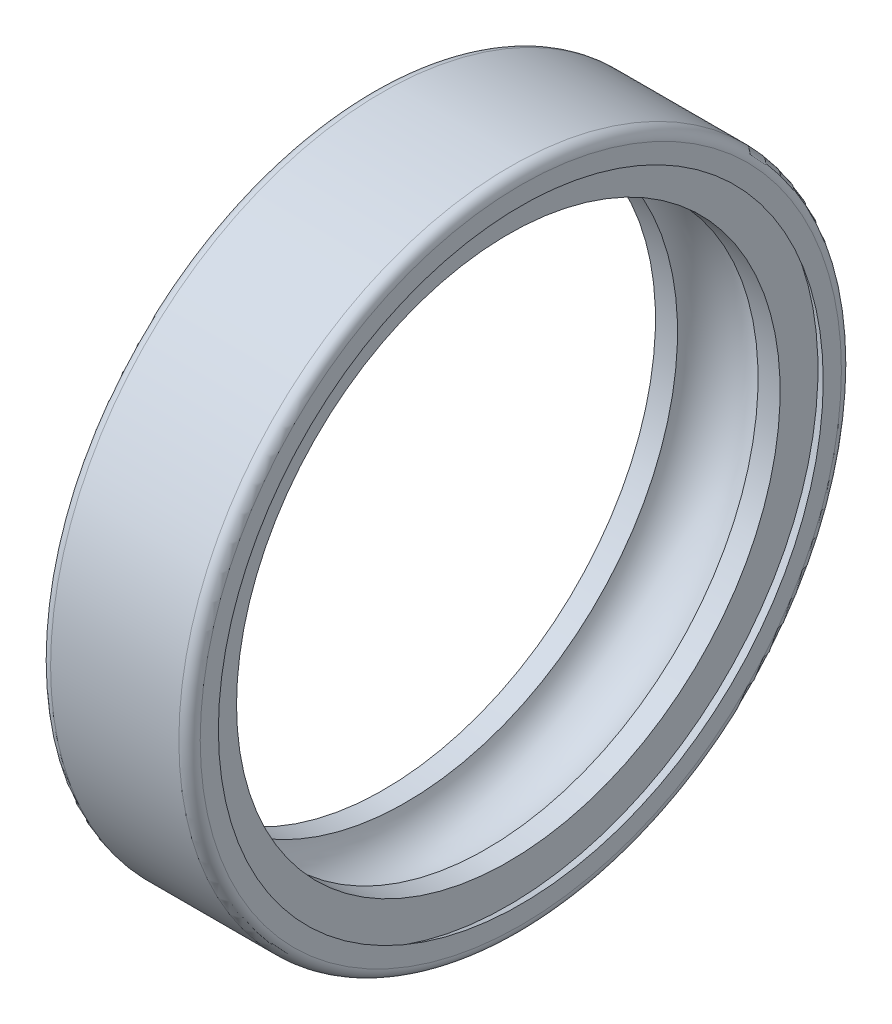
ISO-10303-21;
HEADER;
FILE_DESCRIPTION(('STEP AP214'),'2;1');
FILE_NAME('part.step','',(''),(''),'','','');
FILE_SCHEMA(('AUTOMOTIVE_DESIGN { 1 0 10303 214 1 1 1 1 }'));
ENDSEC;
DATA;
#1=APPLICATION_CONTEXT('core data for automotive mechanical design processes');
#2=APPLICATION_PROTOCOL_DEFINITION('international standard','automotive_design',2000,#1);
#3=PRODUCT_CONTEXT('',#1,'mechanical');
#4=PRODUCT('Part','Part','',(#3));
#5=PRODUCT_RELATED_PRODUCT_CATEGORY('part','',(#4));
#6=PRODUCT_DEFINITION_FORMATION('','',#4);
#7=PRODUCT_DEFINITION_CONTEXT('part definition',#1,'design');
#8=PRODUCT_DEFINITION('design','',#6,#7);
#9=PRODUCT_DEFINITION_SHAPE('','',#8);
#10=(LENGTH_UNIT() NAMED_UNIT(*) SI_UNIT(.MILLI.,.METRE.));
#11=(NAMED_UNIT(*) PLANE_ANGLE_UNIT() SI_UNIT($,.RADIAN.));
#12=(NAMED_UNIT(*) SI_UNIT($,.STERADIAN.) SOLID_ANGLE_UNIT());
#13=UNCERTAINTY_MEASURE_WITH_UNIT(LENGTH_MEASURE(1.E-05),#10,'distance_accuracy_value','');
#14=(GEOMETRIC_REPRESENTATION_CONTEXT(3) GLOBAL_UNCERTAINTY_ASSIGNED_CONTEXT((#13)) GLOBAL_UNIT_ASSIGNED_CONTEXT((#10,
#11,#12)) REPRESENTATION_CONTEXT('',''));
#15=CARTESIAN_POINT('',(0.,0.,0.));
#16=DIRECTION('',(0.,0.,1.));
#17=DIRECTION('',(1.,0.,0.));
#18=AXIS2_PLACEMENT_3D('',#15,#16,#17);
#19=CARTESIAN_POINT('',(0.,0.,0.));
#20=DIRECTION('',(-1.,0.,0.));
#21=DIRECTION('',(0.,0.,1.));
#22=AXIS2_PLACEMENT_3D('',#19,#20,#21);
#23=CYLINDRICAL_SURFACE('',#22,25.435);
#24=CARTESIAN_POINT('',(12.8333333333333,0.,0.));
#25=DIRECTION('',(-1.,0.,0.));
#26=DIRECTION('',(0.,0.,1.));
#27=AXIS2_PLACEMENT_3D('',#24,#25,#26);
#28=CIRCLE('',#27,25.435);
#29=CARTESIAN_POINT('',(12.8333333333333,0.,25.435));
#30=VERTEX_POINT('',#29);
#31=EDGE_CURVE('E10',#30,#30,#28,.T.);
#32=ORIENTED_EDGE('',*,*,#31,.F.);
#33=EDGE_LOOP('',(#32));
#34=FACE_BOUND('',#33,.T.);
#35=CARTESIAN_POINT('',(10.7680598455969,0.,0.));
#36=DIRECTION('',(-1.,0.,0.));
#37=DIRECTION('',(0.,0.,1.));
#38=AXIS2_PLACEMENT_3D('',#35,#36,#37);
#39=CIRCLE('',#38,25.435);
#40=CARTESIAN_POINT('',(10.7680598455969,0.,25.435));
#41=VERTEX_POINT('',#40);
#42=EDGE_CURVE('E55',#41,#41,#39,.T.);
#43=ORIENTED_EDGE('',*,*,#42,.T.);
#44=EDGE_LOOP('',(#43));
#45=FACE_BOUND('',#44,.T.);
#46=ADVANCED_FACE('F14',(#34,#45),#23,.F.);
#47=CARTESIAN_POINT('',(12.8333333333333,25.435,0.));
#48=DIRECTION('',(-1.,0.,0.));
#49=DIRECTION('',(0.,0.,1.));
#50=AXIS2_PLACEMENT_3D('',#47,#48,#49);
#51=PLANE('',#50);
#52=CARTESIAN_POINT('',(12.8333333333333,0.,0.));
#53=DIRECTION('',(-1.,0.,0.));
#54=DIRECTION('',(0.,0.,1.));
#55=AXIS2_PLACEMENT_3D('',#52,#53,#54);
#56=CIRCLE('',#55,28.9735755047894);
#57=CARTESIAN_POINT('',(12.8333333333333,0.,28.9735755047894));
#58=VERTEX_POINT('',#57);
#59=EDGE_CURVE('E20',#58,#58,#56,.T.);
#60=ORIENTED_EDGE('',*,*,#59,.F.);
#61=EDGE_LOOP('',(#60));
#62=FACE_BOUND('',#61,.T.);
#63=ORIENTED_EDGE('',*,*,#31,.T.);
#64=EDGE_LOOP('',(#63));
#65=FACE_BOUND('',#64,.T.);
#66=ADVANCED_FACE('F73',(#62,#65),#51,.F.);
#67=CARTESIAN_POINT('',(12.8333333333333,0.,0.));
#68=DIRECTION('',(-1.,0.,0.));
#69=DIRECTION('',(0.,0.,1.));
#70=AXIS2_PLACEMENT_3D('',#67,#68,#69);
#71=CONICAL_SURFACE('',#70,28.9735755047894,0.523598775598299);
#72=CARTESIAN_POINT('',(14.,0.,0.));
#73=DIRECTION('',(-1.,0.,0.));
#74=DIRECTION('',(0.,0.,1.));
#75=AXIS2_PLACEMENT_3D('',#72,#73,#74);
#76=CIRCLE('',#75,28.3000001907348);
#77=CARTESIAN_POINT('',(14.,0.,28.3000001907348));
#78=VERTEX_POINT('',#77);
#79=EDGE_CURVE('E24',#78,#78,#76,.T.);
#80=ORIENTED_EDGE('',*,*,#79,.F.);
#81=EDGE_LOOP('',(#80));
#82=FACE_BOUND('',#81,.T.);
#83=ORIENTED_EDGE('',*,*,#59,.T.);
#84=EDGE_LOOP('',(#83));
#85=FACE_BOUND('',#84,.T.);
#86=ADVANCED_FACE('F78',(#82,#85),#71,.F.);
#87=CARTESIAN_POINT('',(14.,28.3000001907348,0.));
#88=DIRECTION('',(-1.,0.,0.));
#89=DIRECTION('',(0.,0.,1.));
#90=AXIS2_PLACEMENT_3D('',#87,#88,#89);
#91=PLANE('',#90);
#92=CARTESIAN_POINT('',(14.,0.,0.));
#93=DIRECTION('',(-1.,0.,0.));
#94=DIRECTION('',(0.,0.,1.));
#95=AXIS2_PLACEMENT_3D('',#92,#93,#94);
#96=CIRCLE('',#95,30.);
#97=CARTESIAN_POINT('',(14.,0.,30.));
#98=VERTEX_POINT('',#97);
#99=EDGE_CURVE('E28',#98,#98,#96,.T.);
#100=ORIENTED_EDGE('',*,*,#99,.F.);
#101=EDGE_LOOP('',(#100));
#102=FACE_BOUND('',#101,.T.);
#103=ORIENTED_EDGE('',*,*,#79,.T.);
#104=EDGE_LOOP('',(#103));
#105=FACE_BOUND('',#104,.T.);
#106=ADVANCED_FACE('F83',(#102,#105),#91,.F.);
#107=CARTESIAN_POINT('',(13.,0.,0.));
#108=DIRECTION('',(-1.,0.,0.));
#109=DIRECTION('',(0.,0.,1.));
#110=AXIS2_PLACEMENT_3D('',#107,#108,#109);
#111=TOROIDAL_SURFACE('',#110,30.,1.);
#112=CARTESIAN_POINT('',(13.,0.,0.));
#113=DIRECTION('',(-1.,0.,0.));
#114=DIRECTION('',(0.,0.,1.));
#115=AXIS2_PLACEMENT_3D('',#112,#113,#114);
#116=CIRCLE('',#115,31.);
#117=CARTESIAN_POINT('',(13.,0.,31.));
#118=VERTEX_POINT('',#117);
#119=EDGE_CURVE('E33',#118,#118,#116,.T.);
#120=ORIENTED_EDGE('',*,*,#119,.F.);
#121=EDGE_LOOP('',(#120));
#122=FACE_BOUND('',#121,.T.);
#123=ORIENTED_EDGE('',*,*,#99,.T.);
#124=EDGE_LOOP('',(#123));
#125=FACE_BOUND('',#124,.T.);
#126=ADVANCED_FACE('F89',(#122,#125),#111,.T.);
#127=CARTESIAN_POINT('',(0.,0.,0.));
#128=DIRECTION('',(-1.,0.,0.));
#129=DIRECTION('',(0.,0.,1.));
#130=AXIS2_PLACEMENT_3D('',#127,#128,#129);
#131=CYLINDRICAL_SURFACE('',#130,31.);
#132=CARTESIAN_POINT('',(1.,0.,0.));
#133=DIRECTION('',(-1.,0.,0.));
#134=DIRECTION('',(0.,0.,1.));
#135=AXIS2_PLACEMENT_3D('',#132,#133,#134);
#136=CIRCLE('',#135,31.);
#137=CARTESIAN_POINT('',(1.,0.,31.));
#138=VERTEX_POINT('',#137);
#139=EDGE_CURVE('E36',#138,#138,#136,.T.);
#140=ORIENTED_EDGE('',*,*,#139,.F.);
#141=EDGE_LOOP('',(#140));
#142=FACE_BOUND('',#141,.T.);
#143=ORIENTED_EDGE('',*,*,#119,.T.);
#144=EDGE_LOOP('',(#143));
#145=FACE_BOUND('',#144,.T.);
#146=ADVANCED_FACE('F93',(#142,#145),#131,.T.);
#147=CARTESIAN_POINT('',(1.,0.,0.));
#148=DIRECTION('',(-1.,0.,0.));
#149=DIRECTION('',(0.,0.,1.));
#150=AXIS2_PLACEMENT_3D('',#147,#148,#149);
#151=TOROIDAL_SURFACE('',#150,30.,1.);
#152=CARTESIAN_POINT('',(0.,0.,0.));
#153=DIRECTION('',(-1.,0.,0.));
#154=DIRECTION('',(0.,0.,1.));
#155=AXIS2_PLACEMENT_3D('',#152,#153,#154);
#156=CIRCLE('',#155,30.);
#157=CARTESIAN_POINT('',(0.,0.,30.));
#158=VERTEX_POINT('',#157);
#159=EDGE_CURVE('E39',#158,#158,#156,.T.);
#160=ORIENTED_EDGE('',*,*,#159,.F.);
#161=EDGE_LOOP('',(#160));
#162=FACE_BOUND('',#161,.T.);
#163=ORIENTED_EDGE('',*,*,#139,.T.);
#164=EDGE_LOOP('',(#163));
#165=FACE_BOUND('',#164,.T.);
#166=ADVANCED_FACE('F97',(#162,#165),#151,.T.);
#167=CARTESIAN_POINT('',(0.,30.,0.));
#168=DIRECTION('',(1.,0.,0.));
#169=DIRECTION('',(0.,0.,-1.));
#170=AXIS2_PLACEMENT_3D('',#167,#168,#169);
#171=PLANE('',#170);
#172=CARTESIAN_POINT('',(0.,0.,0.));
#173=DIRECTION('',(-1.,0.,0.));
#174=DIRECTION('',(0.,0.,1.));
#175=AXIS2_PLACEMENT_3D('',#172,#173,#174);
#176=CIRCLE('',#175,28.3000001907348);
#177=CARTESIAN_POINT('',(0.,0.,28.3000001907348));
#178=VERTEX_POINT('',#177);
#179=EDGE_CURVE('E43',#178,#178,#176,.T.);
#180=ORIENTED_EDGE('',*,*,#179,.F.);
#181=EDGE_LOOP('',(#180));
#182=FACE_BOUND('',#181,.T.);
#183=ORIENTED_EDGE('',*,*,#159,.T.);
#184=EDGE_LOOP('',(#183));
#185=FACE_BOUND('',#184,.T.);
#186=ADVANCED_FACE('F101',(#182,#185),#171,.F.);
#187=CARTESIAN_POINT('',(0.,0.,0.));
#188=DIRECTION('',(1.,0.,0.));
#189=DIRECTION('',(0.,0.,-1.));
#190=AXIS2_PLACEMENT_3D('',#187,#188,#189);
#191=CONICAL_SURFACE('',#190,28.3000001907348,0.523598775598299);
#192=CARTESIAN_POINT('',(1.16666666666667,0.,0.));
#193=DIRECTION('',(-1.,0.,0.));
#194=DIRECTION('',(0.,0.,1.));
#195=AXIS2_PLACEMENT_3D('',#192,#193,#194);
#196=CIRCLE('',#195,28.9735755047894);
#197=CARTESIAN_POINT('',(1.16666666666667,0.,28.9735755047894));
#198=VERTEX_POINT('',#197);
#199=EDGE_CURVE('E46',#198,#198,#196,.T.);
#200=ORIENTED_EDGE('',*,*,#199,.F.);
#201=EDGE_LOOP('',(#200));
#202=FACE_BOUND('',#201,.T.);
#203=ORIENTED_EDGE('',*,*,#179,.T.);
#204=EDGE_LOOP('',(#203));
#205=FACE_BOUND('',#204,.T.);
#206=ADVANCED_FACE('F105',(#202,#205),#191,.F.);
#207=CARTESIAN_POINT('',(1.16666666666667,28.9735755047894,0.));
#208=DIRECTION('',(1.,0.,0.));
#209=DIRECTION('',(0.,0.,-1.));
#210=AXIS2_PLACEMENT_3D('',#207,#208,#209);
#211=PLANE('',#210);
#212=CARTESIAN_POINT('',(1.16666666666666,0.,0.));
#213=DIRECTION('',(-1.,0.,0.));
#214=DIRECTION('',(0.,0.,1.));
#215=AXIS2_PLACEMENT_3D('',#212,#213,#214);
#216=CIRCLE('',#215,25.435);
#217=CARTESIAN_POINT('',(1.16666666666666,0.,25.435));
#218=VERTEX_POINT('',#217);
#219=EDGE_CURVE('E49',#218,#218,#216,.T.);
#220=ORIENTED_EDGE('',*,*,#219,.F.);
#221=EDGE_LOOP('',(#220));
#222=FACE_BOUND('',#221,.T.);
#223=ORIENTED_EDGE('',*,*,#199,.T.);
#224=EDGE_LOOP('',(#223));
#225=FACE_BOUND('',#224,.T.);
#226=ADVANCED_FACE('F69',(#222,#225),#211,.F.);
#227=CARTESIAN_POINT('',(0.,0.,0.));
#228=DIRECTION('',(-1.,0.,0.));
#229=DIRECTION('',(0.,0.,1.));
#230=AXIS2_PLACEMENT_3D('',#227,#228,#229);
#231=CYLINDRICAL_SURFACE('',#230,25.435);
#232=CARTESIAN_POINT('',(3.23194015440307,0.,0.));
#233=DIRECTION('',(-1.,0.,0.));
#234=DIRECTION('',(0.,0.,1.));
#235=AXIS2_PLACEMENT_3D('',#232,#233,#234);
#236=CIRCLE('',#235,25.435);
#237=CARTESIAN_POINT('',(3.23194015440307,0.,25.435));
#238=VERTEX_POINT('',#237);
#239=EDGE_CURVE('E52',#238,#238,#236,.T.);
#240=ORIENTED_EDGE('',*,*,#239,.F.);
#241=EDGE_LOOP('',(#240));
#242=FACE_BOUND('',#241,.T.);
#243=ORIENTED_EDGE('',*,*,#219,.T.);
#244=EDGE_LOOP('',(#243));
#245=FACE_BOUND('',#244,.T.);
#246=ADVANCED_FACE('F62',(#242,#245),#231,.F.);
#247=CARTESIAN_POINT('',(7.,0.,0.));
#248=DIRECTION('',(-1.,0.,0.));
#249=DIRECTION('',(0.,0.,1.));
#250=AXIS2_PLACEMENT_3D('',#247,#248,#249);
#251=TOROIDAL_SURFACE('',#250,24.25,3.95);
#252=ORIENTED_EDGE('',*,*,#239,.T.);
#253=EDGE_LOOP('',(#252));
#254=FACE_BOUND('',#253,.T.);
#255=ORIENTED_EDGE('',*,*,#42,.F.);
#256=EDGE_LOOP('',(#255));
#257=FACE_BOUND('',#256,.T.);
#258=ADVANCED_FACE('F60',(#254,#257),#251,.F.);
#259=CLOSED_SHELL('',(#46,#66,#86,#106,#126,#146,#166,#186,#206,#226,#246,#258));
#260=MANIFOLD_SOLID_BREP('B1',#259);
#261=ADVANCED_BREP_SHAPE_REPRESENTATION('',(#18,#260),#14);
#262=SHAPE_DEFINITION_REPRESENTATION(#9,#261);
ENDSEC;
END-ISO-10303-21;
